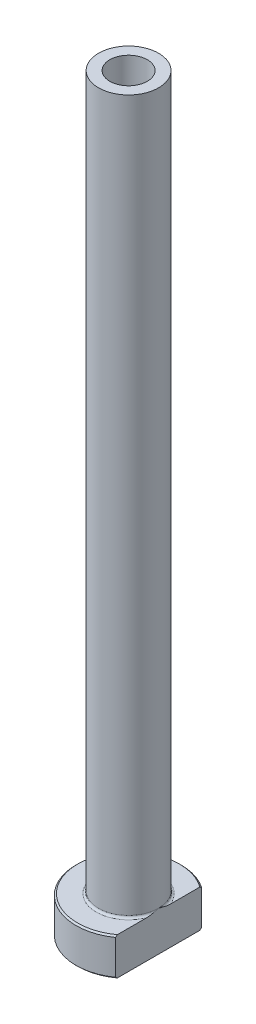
from build123d import *

# Parameters (mm, degrees)
FILLET1_R          = 0.3
CHAMFER1_SIZE      = 0.2
CUT_EXTRUDE1_DEPTH = 101.488805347
CHAMFER2_SIZE      = 0.5


with BuildPart() as part:
    # Sketch1 → Revolve1 (revolve)
    with BuildSketch(Plane.XY, mode=Mode.PRIVATE) as revolve1_sk:
        Polygon((-2.5, 100), (-4, 100), (-4, 5), (-7, 5), (-7, 0), (-2.75, 0), (-2.75, 43), (-2.5, 55), align=None)
    revolve(revolve1_sk.sketch.rotate(Axis((0, 92.187680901, 0), (0, -1, 0)), 270), axis=Axis((0, 92.187680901, 0), (0, -1, 0)))

    # Fillet1
    fillet1_edges = [part.edges().sort_by_distance(p)[0] for p in [
        (0, 5, -4),
    ]]
    fillet(fillet1_edges, radius=FILLET1_R)

    # Chamfer1
    chamfer1_edges = [part.edges().sort_by_distance(p)[0] for p in [
        (0, 0, -7),
        (0, 5, -7),
    ]]
    chamfer(chamfer1_edges, length=CHAMFER1_SIZE)

    # Sketch2 → Cut-Extrude1 (cut, through all)
    with BuildSketch(Plane.XZ):
        with BuildLine():
            Line((4, 5.744562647), (4, -5.744562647))
            ThreePointArc((4, -5.744562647), (7, 0), (4, 5.744562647))
        make_face()
    extrude(amount=-CUT_EXTRUDE1_DEPTH, mode=Mode.SUBTRACT)

    # Chamfer2
    chamfer2_edges = [part.edges().sort_by_distance(p)[0] for p in [
        (0, 0, -2.75),
    ]]
    chamfer(chamfer2_edges, length=CHAMFER2_SIZE)


solid = part.part
